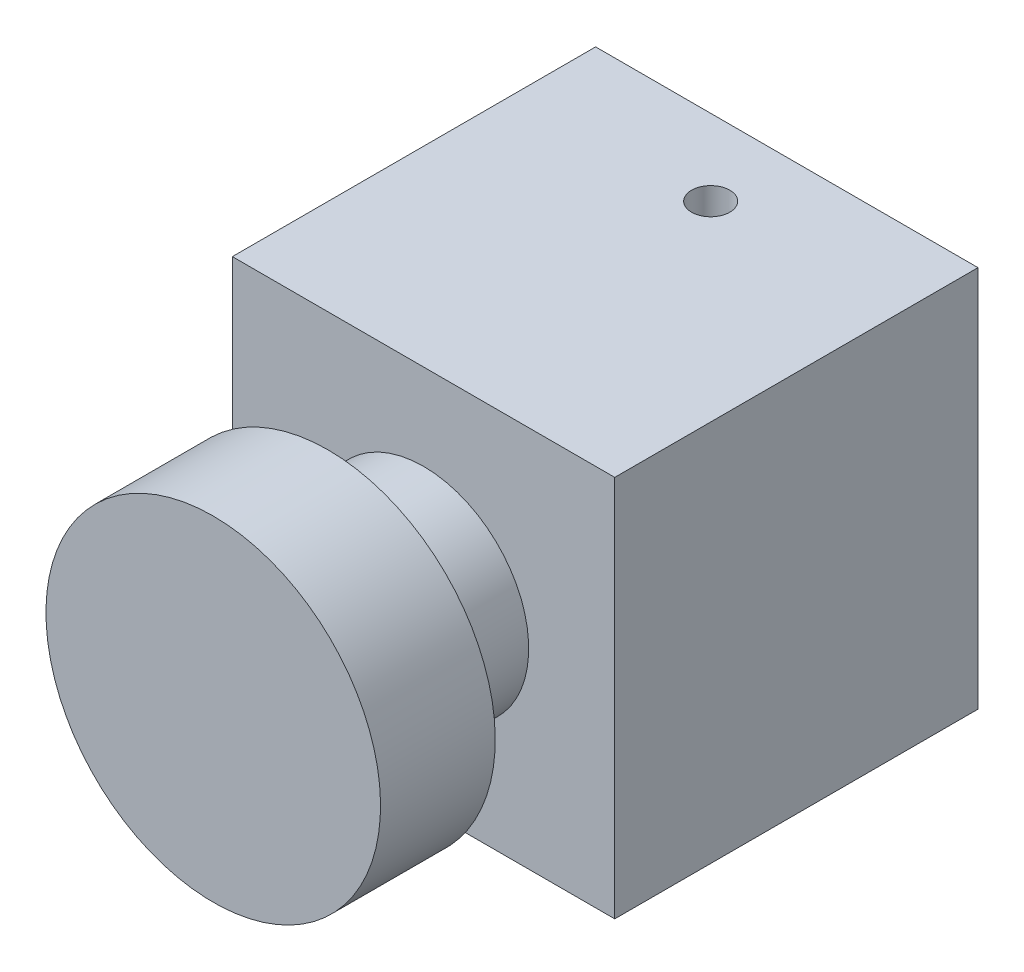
ISO-10303-21;
HEADER;
FILE_DESCRIPTION(('STEP AP214'),'2;1');
FILE_NAME('part.step','',(''),(''),'','','');
FILE_SCHEMA(('AUTOMOTIVE_DESIGN { 1 0 10303 214 1 1 1 1 }'));
ENDSEC;
DATA;
#1=APPLICATION_CONTEXT('core data for automotive mechanical design processes');
#2=APPLICATION_PROTOCOL_DEFINITION('international standard','automotive_design',2000,#1);
#3=PRODUCT_CONTEXT('',#1,'mechanical');
#4=PRODUCT('Part','Part','',(#3));
#5=PRODUCT_RELATED_PRODUCT_CATEGORY('part','',(#4));
#6=PRODUCT_DEFINITION_FORMATION('','',#4);
#7=PRODUCT_DEFINITION_CONTEXT('part definition',#1,'design');
#8=PRODUCT_DEFINITION('design','',#6,#7);
#9=PRODUCT_DEFINITION_SHAPE('','',#8);
#10=(LENGTH_UNIT() NAMED_UNIT(*) SI_UNIT(.MILLI.,.METRE.));
#11=(NAMED_UNIT(*) PLANE_ANGLE_UNIT() SI_UNIT($,.RADIAN.));
#12=(NAMED_UNIT(*) SI_UNIT($,.STERADIAN.) SOLID_ANGLE_UNIT());
#13=UNCERTAINTY_MEASURE_WITH_UNIT(LENGTH_MEASURE(1.E-05),#10,'distance_accuracy_value','');
#14=(GEOMETRIC_REPRESENTATION_CONTEXT(3) GLOBAL_UNCERTAINTY_ASSIGNED_CONTEXT((#13)) GLOBAL_UNIT_ASSIGNED_CONTEXT((#10,
#11,#12)) REPRESENTATION_CONTEXT('',''));
#15=CARTESIAN_POINT('',(0.,0.,0.));
#16=DIRECTION('',(0.,0.,1.));
#17=DIRECTION('',(1.,0.,0.));
#18=AXIS2_PLACEMENT_3D('',#15,#16,#17);
#19=CARTESIAN_POINT('',(20.,-20.,56.5685424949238));
#20=DIRECTION('',(0.,-1.,0.));
#21=DIRECTION('',(0.,0.,-1.));
#22=AXIS2_PLACEMENT_3D('',#19,#20,#21);
#23=PLANE('',#22);
#24=DIRECTION('',(1.,0.,0.));
#25=VECTOR('',#24,1.);
#26=CARTESIAN_POINT('',(20.,-20.,-9.99999999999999));
#27=LINE('',#26,#25);
#28=CARTESIAN_POINT('',(-20.,-20.,-9.99999999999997));
#29=VERTEX_POINT('',#28);
#30=CARTESIAN_POINT('',(20.,-20.,-9.99999999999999));
#31=VERTEX_POINT('',#30);
#32=EDGE_CURVE('E59',#29,#31,#27,.T.);
#33=ORIENTED_EDGE('',*,*,#32,.F.);
#34=DIRECTION('',(0.,0.,-1.));
#35=VECTOR('',#34,1.);
#36=CARTESIAN_POINT('',(-20.,-20.,56.5685424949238));
#37=LINE('',#36,#35);
#38=CARTESIAN_POINT('',(-20.,-20.,-48.));
#39=VERTEX_POINT('',#38);
#40=EDGE_CURVE('E88',#29,#39,#37,.T.);
#41=ORIENTED_EDGE('',*,*,#40,.T.);
#42=DIRECTION('',(-1.,0.,0.));
#43=VECTOR('',#42,1.);
#44=CARTESIAN_POINT('',(20.,-20.,-48.));
#45=LINE('',#44,#43);
#46=CARTESIAN_POINT('',(20.,-20.,-48.));
#47=VERTEX_POINT('',#46);
#48=EDGE_CURVE('E92',#47,#39,#45,.T.);
#49=ORIENTED_EDGE('',*,*,#48,.F.);
#50=DIRECTION('',(0.,0.,-1.));
#51=VECTOR('',#50,1.);
#52=CARTESIAN_POINT('',(20.,-20.,56.5685424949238));
#53=LINE('',#52,#51);
#54=EDGE_CURVE('E79',#31,#47,#53,.T.);
#55=ORIENTED_EDGE('',*,*,#54,.F.);
#56=EDGE_LOOP('',(#33,#41,#49,#55));
#57=FACE_BOUND('',#56,.T.);
#58=CARTESIAN_POINT('',(0.,-20.,-40.036711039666));
#59=DIRECTION('',(0.,1.,0.));
#60=DIRECTION('',(0.,0.,1.));
#61=AXIS2_PLACEMENT_3D('',#58,#59,#60);
#62=CIRCLE('',#61,2.);
#63=CARTESIAN_POINT('',(0.,-20.,-38.036711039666));
#64=VERTEX_POINT('',#63);
#65=EDGE_CURVE('E186',#64,#64,#62,.T.);
#66=ORIENTED_EDGE('',*,*,#65,.T.);
#67=EDGE_LOOP('',(#66));
#68=FACE_BOUND('',#67,.T.);
#69=ADVANCED_FACE('F41',(#57,#68),#23,.T.);
#70=CARTESIAN_POINT('',(0.,0.,0.));
#71=DIRECTION('',(0.,0.,-1.));
#72=DIRECTION('',(0.,1.,0.));
#73=AXIS2_PLACEMENT_3D('',#70,#71,#72);
#74=CYLINDRICAL_SURFACE('',#73,11.);
#75=CARTESIAN_POINT('',(0.,0.,0.));
#76=DIRECTION('',(0.,0.,-1.));
#77=DIRECTION('',(0.,1.,0.));
#78=AXIS2_PLACEMENT_3D('',#75,#76,#77);
#79=CIRCLE('',#78,11.);
#80=CARTESIAN_POINT('',(0.,11.,0.));
#81=VERTEX_POINT('',#80);
#82=EDGE_CURVE('E13',#81,#81,#79,.T.);
#83=ORIENTED_EDGE('',*,*,#82,.T.);
#84=EDGE_LOOP('',(#83));
#85=FACE_BOUND('',#84,.T.);
#86=CARTESIAN_POINT('',(0.,0.,-10.));
#87=DIRECTION('',(0.,0.,-1.));
#88=DIRECTION('',(0.,1.,0.));
#89=AXIS2_PLACEMENT_3D('',#86,#87,#88);
#90=CIRCLE('',#89,11.);
#91=CARTESIAN_POINT('',(0.,11.,-10.));
#92=VERTEX_POINT('',#91);
#93=EDGE_CURVE('E45',#92,#92,#90,.F.);
#94=ORIENTED_EDGE('',*,*,#93,.T.);
#95=EDGE_LOOP('',(#94));
#96=FACE_BOUND('',#95,.T.);
#97=ADVANCED_FACE('F135',(#85,#96),#74,.T.);
#98=CARTESIAN_POINT('',(0.,17.5,12.));
#99=DIRECTION('',(0.,0.,1.));
#100=DIRECTION('',(0.,-1.,0.));
#101=AXIS2_PLACEMENT_3D('',#98,#99,#100);
#102=PLANE('',#101);
#103=CARTESIAN_POINT('',(0.,0.,12.));
#104=DIRECTION('',(0.,0.,-1.));
#105=DIRECTION('',(0.,1.,0.));
#106=AXIS2_PLACEMENT_3D('',#103,#104,#105);
#107=CIRCLE('',#106,17.5);
#108=CARTESIAN_POINT('',(0.,17.5,12.));
#109=VERTEX_POINT('',#108);
#110=EDGE_CURVE('E119',#109,#109,#107,.T.);
#111=ORIENTED_EDGE('',*,*,#110,.F.);
#112=EDGE_LOOP('',(#111));
#113=FACE_BOUND('',#112,.T.);
#114=ADVANCED_FACE('F43',(#113),#102,.T.);
#115=CARTESIAN_POINT('',(0.,11.,0.));
#116=DIRECTION('',(0.,0.,-1.));
#117=DIRECTION('',(0.,1.,0.));
#118=AXIS2_PLACEMENT_3D('',#115,#116,#117);
#119=PLANE('',#118);
#120=CARTESIAN_POINT('',(0.,0.,0.));
#121=DIRECTION('',(0.,0.,-1.));
#122=DIRECTION('',(0.,1.,0.));
#123=AXIS2_PLACEMENT_3D('',#120,#121,#122);
#124=CIRCLE('',#123,17.5);
#125=CARTESIAN_POINT('',(0.,17.5,0.));
#126=VERTEX_POINT('',#125);
#127=EDGE_CURVE('E51',#126,#126,#124,.T.);
#128=ORIENTED_EDGE('',*,*,#127,.T.);
#129=EDGE_LOOP('',(#128));
#130=FACE_BOUND('',#129,.T.);
#131=ORIENTED_EDGE('',*,*,#82,.F.);
#132=EDGE_LOOP('',(#131));
#133=FACE_BOUND('',#132,.T.);
#134=ADVANCED_FACE('F125',(#130,#133),#119,.T.);
#135=CARTESIAN_POINT('',(0.,0.,0.));
#136=DIRECTION('',(0.,0.,-1.));
#137=DIRECTION('',(0.,1.,0.));
#138=AXIS2_PLACEMENT_3D('',#135,#136,#137);
#139=CYLINDRICAL_SURFACE('',#138,17.5);
#140=ORIENTED_EDGE('',*,*,#127,.F.);
#141=EDGE_LOOP('',(#140));
#142=FACE_BOUND('',#141,.T.);
#143=ORIENTED_EDGE('',*,*,#110,.T.);
#144=EDGE_LOOP('',(#143));
#145=FACE_BOUND('',#144,.T.);
#146=ADVANCED_FACE('F128',(#142,#145),#139,.T.);
#147=CARTESIAN_POINT('',(20.,20.,56.5685424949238));
#148=DIRECTION('',(1.,0.,0.));
#149=DIRECTION('',(0.,1.,0.));
#150=AXIS2_PLACEMENT_3D('',#147,#148,#149);
#151=PLANE('',#150);
#152=DIRECTION('',(0.,1.,0.));
#153=VECTOR('',#152,1.);
#154=CARTESIAN_POINT('',(20.,20.,-9.99999999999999));
#155=LINE('',#154,#153);
#156=CARTESIAN_POINT('',(20.,20.,-9.99999999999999));
#157=VERTEX_POINT('',#156);
#158=EDGE_CURVE('E86',#31,#157,#155,.T.);
#159=ORIENTED_EDGE('',*,*,#158,.F.);
#160=ORIENTED_EDGE('',*,*,#54,.T.);
#161=DIRECTION('',(0.,-1.,0.));
#162=VECTOR('',#161,1.);
#163=CARTESIAN_POINT('',(20.,20.,-48.));
#164=LINE('',#163,#162);
#165=CARTESIAN_POINT('',(20.,20.,-48.));
#166=VERTEX_POINT('',#165);
#167=EDGE_CURVE('E84',#166,#47,#164,.T.);
#168=ORIENTED_EDGE('',*,*,#167,.F.);
#169=DIRECTION('',(0.,0.,-1.));
#170=VECTOR('',#169,1.);
#171=CARTESIAN_POINT('',(20.,20.,56.5685424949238));
#172=LINE('',#171,#170);
#173=EDGE_CURVE('E112',#157,#166,#172,.T.);
#174=ORIENTED_EDGE('',*,*,#173,.F.);
#175=EDGE_LOOP('',(#159,#160,#168,#174));
#176=FACE_BOUND('',#175,.T.);
#177=ADVANCED_FACE('F81',(#176),#151,.T.);
#178=CARTESIAN_POINT('',(20.,20.,56.5685424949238));
#179=DIRECTION('',(0.,1.,0.));
#180=DIRECTION('',(0.,0.,1.));
#181=AXIS2_PLACEMENT_3D('',#178,#179,#180);
#182=PLANE('',#181);
#183=CARTESIAN_POINT('',(0.,20.,-40.036711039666));
#184=DIRECTION('',(0.,1.,0.));
#185=DIRECTION('',(0.,0.,1.));
#186=AXIS2_PLACEMENT_3D('',#183,#184,#185);
#187=CIRCLE('',#186,2.);
#188=CARTESIAN_POINT('',(0.,20.,-38.036711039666));
#189=VERTEX_POINT('',#188);
#190=EDGE_CURVE('E105',#189,#189,#187,.T.);
#191=ORIENTED_EDGE('',*,*,#190,.F.);
#192=EDGE_LOOP('',(#191));
#193=FACE_BOUND('',#192,.T.);
#194=DIRECTION('',(-1.,0.,0.));
#195=VECTOR('',#194,1.);
#196=CARTESIAN_POINT('',(20.,20.,-9.99999999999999));
#197=LINE('',#196,#195);
#198=CARTESIAN_POINT('',(-20.,20.,-9.99999999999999));
#199=VERTEX_POINT('',#198);
#200=EDGE_CURVE('E180',#157,#199,#197,.T.);
#201=ORIENTED_EDGE('',*,*,#200,.F.);
#202=ORIENTED_EDGE('',*,*,#173,.T.);
#203=DIRECTION('',(1.,0.,0.));
#204=VECTOR('',#203,1.);
#205=CARTESIAN_POINT('',(20.,20.,-48.));
#206=LINE('',#205,#204);
#207=CARTESIAN_POINT('',(-20.,20.,-48.));
#208=VERTEX_POINT('',#207);
#209=EDGE_CURVE('E89',#208,#166,#206,.T.);
#210=ORIENTED_EDGE('',*,*,#209,.F.);
#211=DIRECTION('',(0.,0.,-1.));
#212=VECTOR('',#211,1.);
#213=CARTESIAN_POINT('',(-20.,20.,56.5685424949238));
#214=LINE('',#213,#212);
#215=EDGE_CURVE('E115',#199,#208,#214,.T.);
#216=ORIENTED_EDGE('',*,*,#215,.F.);
#217=EDGE_LOOP('',(#201,#202,#210,#216));
#218=FACE_BOUND('',#217,.T.);
#219=ADVANCED_FACE('F152',(#193,#218),#182,.T.);
#220=CARTESIAN_POINT('',(-20.,20.,56.5685424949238));
#221=DIRECTION('',(-1.,0.,0.));
#222=DIRECTION('',(0.,0.,1.));
#223=AXIS2_PLACEMENT_3D('',#220,#221,#222);
#224=PLANE('',#223);
#225=DIRECTION('',(0.,-1.,0.));
#226=VECTOR('',#225,1.);
#227=CARTESIAN_POINT('',(-20.,20.,-9.99999999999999));
#228=LINE('',#227,#226);
#229=EDGE_CURVE('E114',#199,#29,#228,.T.);
#230=ORIENTED_EDGE('',*,*,#229,.F.);
#231=ORIENTED_EDGE('',*,*,#215,.T.);
#232=DIRECTION('',(0.,1.,0.));
#233=VECTOR('',#232,1.);
#234=CARTESIAN_POINT('',(-20.,20.,-48.));
#235=LINE('',#234,#233);
#236=EDGE_CURVE('E98',#39,#208,#235,.T.);
#237=ORIENTED_EDGE('',*,*,#236,.F.);
#238=ORIENTED_EDGE('',*,*,#40,.F.);
#239=EDGE_LOOP('',(#230,#231,#237,#238));
#240=FACE_BOUND('',#239,.T.);
#241=ADVANCED_FACE('F149',(#240),#224,.T.);
#242=CARTESIAN_POINT('',(0.,11.,-10.));
#243=DIRECTION('',(0.,0.,-1.));
#244=DIRECTION('',(0.,1.,0.));
#245=AXIS2_PLACEMENT_3D('',#242,#243,#244);
#246=PLANE('',#245);
#247=ORIENTED_EDGE('',*,*,#93,.F.);
#248=EDGE_LOOP('',(#247));
#249=FACE_BOUND('',#248,.T.);
#250=ORIENTED_EDGE('',*,*,#158,.T.);
#251=ORIENTED_EDGE('',*,*,#200,.T.);
#252=ORIENTED_EDGE('',*,*,#229,.T.);
#253=ORIENTED_EDGE('',*,*,#32,.T.);
#254=EDGE_LOOP('',(#250,#251,#252,#253));
#255=FACE_BOUND('',#254,.T.);
#256=ADVANCED_FACE('F155',(#249,#255),#246,.F.);
#257=CARTESIAN_POINT('',(0.,11.,-48.));
#258=DIRECTION('',(0.,0.,1.));
#259=DIRECTION('',(0.,-1.,0.));
#260=AXIS2_PLACEMENT_3D('',#257,#258,#259);
#261=PLANE('',#260);
#262=ORIENTED_EDGE('',*,*,#167,.T.);
#263=ORIENTED_EDGE('',*,*,#48,.T.);
#264=ORIENTED_EDGE('',*,*,#236,.T.);
#265=ORIENTED_EDGE('',*,*,#209,.T.);
#266=EDGE_LOOP('',(#262,#263,#264,#265));
#267=FACE_BOUND('',#266,.T.);
#268=ADVANCED_FACE('F100',(#267),#261,.F.);
#269=CARTESIAN_POINT('',(0.,15.,-40.036711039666));
#270=DIRECTION('',(0.,1.,0.));
#271=DIRECTION('',(0.,0.,1.));
#272=AXIS2_PLACEMENT_3D('',#269,#270,#271);
#273=CYLINDRICAL_SURFACE('',#272,2.);
#274=CARTESIAN_POINT('',(0.,15.,-40.036711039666));
#275=DIRECTION('',(0.,1.,0.));
#276=DIRECTION('',(0.,0.,1.));
#277=AXIS2_PLACEMENT_3D('',#274,#275,#276);
#278=CIRCLE('',#277,2.);
#279=CARTESIAN_POINT('',(0.,15.,-38.036711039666));
#280=VERTEX_POINT('',#279);
#281=EDGE_CURVE('E102',#280,#280,#278,.T.);
#282=ORIENTED_EDGE('',*,*,#281,.F.);
#283=EDGE_LOOP('',(#282));
#284=FACE_BOUND('',#283,.T.);
#285=ORIENTED_EDGE('',*,*,#190,.T.);
#286=EDGE_LOOP('',(#285));
#287=FACE_BOUND('',#286,.T.);
#288=ADVANCED_FACE('F154',(#284,#287),#273,.F.);
#289=CARTESIAN_POINT('',(0.,15.,-40.036711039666));
#290=DIRECTION('',(0.,1.,0.));
#291=DIRECTION('',(0.,0.,1.));
#292=AXIS2_PLACEMENT_3D('',#289,#290,#291);
#293=PLANE('',#292);
#294=ORIENTED_EDGE('',*,*,#281,.T.);
#295=EDGE_LOOP('',(#294));
#296=FACE_BOUND('',#295,.T.);
#297=ADVANCED_FACE('F160',(#296),#293,.T.);
#298=CARTESIAN_POINT('',(0.,-15.,-40.036711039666));
#299=DIRECTION('',(0.,-1.,0.));
#300=DIRECTION('',(0.,0.,-1.));
#301=AXIS2_PLACEMENT_3D('',#298,#299,#300);
#302=CYLINDRICAL_SURFACE('',#301,2.);
#303=CARTESIAN_POINT('',(0.,-15.,-40.036711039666));
#304=DIRECTION('',(0.,1.,0.));
#305=DIRECTION('',(0.,0.,1.));
#306=AXIS2_PLACEMENT_3D('',#303,#304,#305);
#307=CIRCLE('',#306,2.);
#308=CARTESIAN_POINT('',(0.,-15.,-38.036711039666));
#309=VERTEX_POINT('',#308);
#310=EDGE_CURVE('E184',#309,#309,#307,.T.);
#311=ORIENTED_EDGE('',*,*,#310,.T.);
#312=EDGE_LOOP('',(#311));
#313=FACE_BOUND('',#312,.T.);
#314=ORIENTED_EDGE('',*,*,#65,.F.);
#315=EDGE_LOOP('',(#314));
#316=FACE_BOUND('',#315,.T.);
#317=ADVANCED_FACE('F192',(#313,#316),#302,.F.);
#318=CARTESIAN_POINT('',(0.,-15.,-40.036711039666));
#319=DIRECTION('',(0.,-1.,0.));
#320=DIRECTION('',(0.,0.,1.));
#321=AXIS2_PLACEMENT_3D('',#318,#319,#320);
#322=PLANE('',#321);
#323=ORIENTED_EDGE('',*,*,#310,.F.);
#324=EDGE_LOOP('',(#323));
#325=FACE_BOUND('',#324,.T.);
#326=ADVANCED_FACE('F195',(#325),#322,.T.);
#327=CLOSED_SHELL('',(#69,#97,#114,#134,#146,#177,#219,#241,#256,#268,#288,#297,#317,#326));
#328=MANIFOLD_SOLID_BREP('B2',#327);
#329=ADVANCED_BREP_SHAPE_REPRESENTATION('',(#18,#328),#14);
#330=SHAPE_DEFINITION_REPRESENTATION(#9,#329);
ENDSEC;
END-ISO-10303-21;
